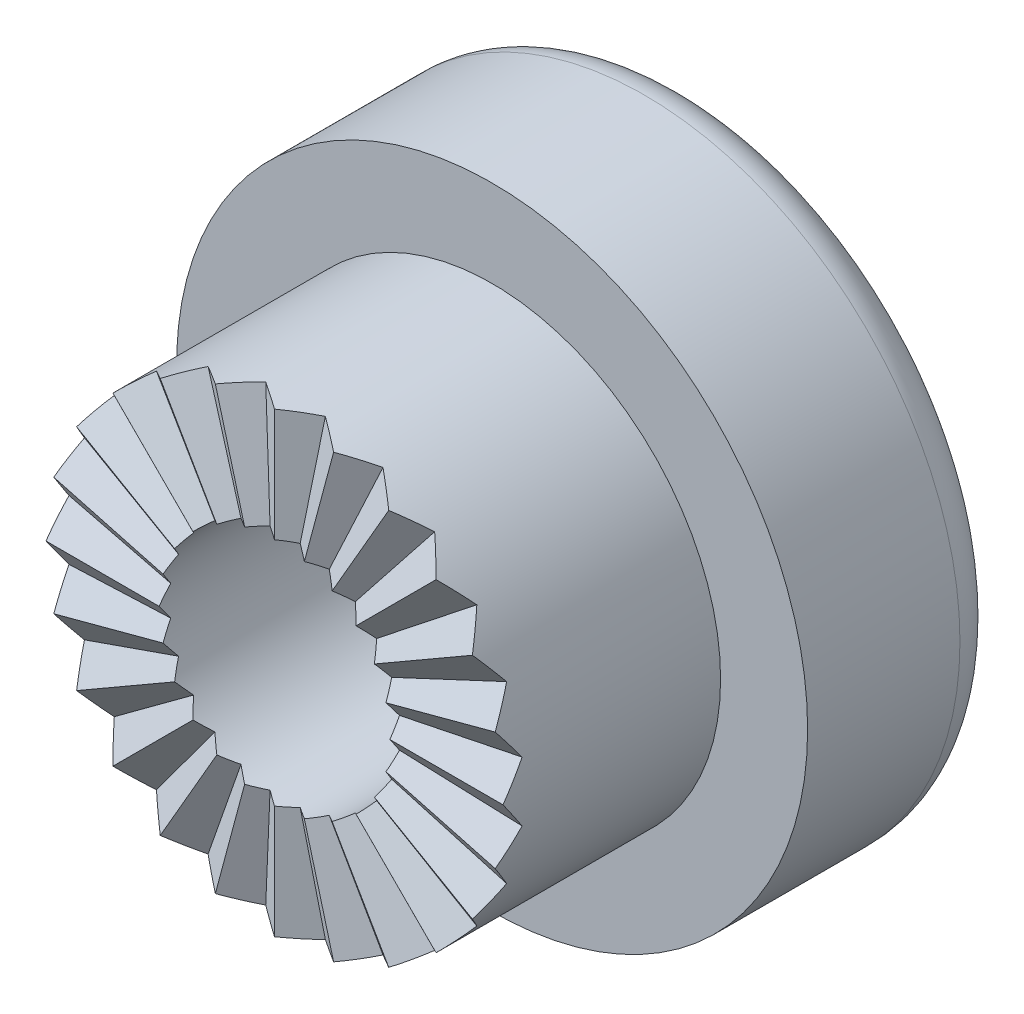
from build123d import *

# Parameters (mm, degrees)
ESQUISSE1_R                  = 7.25
EXTRUSION1_DEPTH             = 4.5
ESQUISSE2_R                  = 5.25
EXTRUSION2_DEPTH             = 5
PER_AGE1_D                   = 5.3
PER_AGE1_DEPTH               = 9.5
PER_AGE1_CBORE_D             = 10.3
PER_AGE1_CBORE_DEPTH         = 2.5
PER_AGE1_TIP                 = 1.59228064
CONG_1_R                     = 1
R_P_TITION_CIRCULAIRE1_COUNT = 24


with BuildPart() as part:
    # Esquisse1 → Extrusion1 (new body)
    with BuildSketch(Plane.XY):
        Circle(ESQUISSE1_R)
    extrude(amount=-EXTRUSION1_DEPTH)

    # Esquisse2 → Extrusion2 (add)
    with BuildSketch(Plane.XY):
        Circle(ESQUISSE2_R)
    extrude(amount=EXTRUSION2_DEPTH)

    # Per_age1
    with Locations(Plane(origin=(0, 0, -4.5), x_dir=(-1, 0, 0), z_dir=(0, 0, -1))):
        with Locations((0, 0)):
            CounterBoreHole(PER_AGE1_D / 2, PER_AGE1_CBORE_D / 2, PER_AGE1_CBORE_DEPTH, depth=PER_AGE1_DEPTH)
            with Locations((0, 0, -(PER_AGE1_DEPTH + PER_AGE1_TIP / 2))):  # 118° drill point
                Cone(0, PER_AGE1_D / 2, PER_AGE1_TIP, mode=Mode.SUBTRACT)

    # Cong_1
    cong_1_edges = [part.edges().sort_by_distance(p)[0] for p in [
        (-7.25, 0, -4.5),
    ]]
    fillet(cong_1_edges, radius=CONG_1_R)

    # Esquisse7 → Enl_vement de mati_re-Lissage1 section 0
    with BuildSketch(Plane(origin=(0.342935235, 2.60485172, 5), x_dir=(-0.9914448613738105, 0.1305261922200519, 0), z_dir=(0.1305261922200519, 0.9914448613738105, 0))):
        with BuildLine():
            Line((-0.345894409, 0), (0, -0.242197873))
            Line((0, -0.242197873), (0.345894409, 0))
            Line((0.345894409, 0), (-0.345894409, 0))
        make_face()
    # Esquisse6 → Enl_vement de mati_re-Lissage1 section 1
    with BuildSketch(Plane(origin=(0.808809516, 6.143518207, 5), x_dir=(-0.9914448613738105, 0.1305261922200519, 0), z_dir=(0.1305261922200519, 0.9914448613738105, 0))):
        with BuildLine():
            Line((-0.815788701, 0), (0, -0.571221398))
            Line((0, -0.571221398), (0.815788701, 0))
            Line((0.815788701, 0), (-0.815788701, 0))
        make_face()
    enl_vement_de_mati_re_lissage1 = loft(mode=Mode.SUBTRACT)

    # R_p_tition circulaire1: Enl_vement de mati_re-Lissage1 ×24 about axis
    r_p_tition_circulaire1_axis = Axis((0, 0, 0), (0, 0, 1))
    for i in range(1, R_P_TITION_CIRCULAIRE1_COUNT):
        add(enl_vement_de_mati_re_lissage1.rotate(r_p_tition_circulaire1_axis, i * 360 / R_P_TITION_CIRCULAIRE1_COUNT), mode=Mode.SUBTRACT)


solid = part.part
